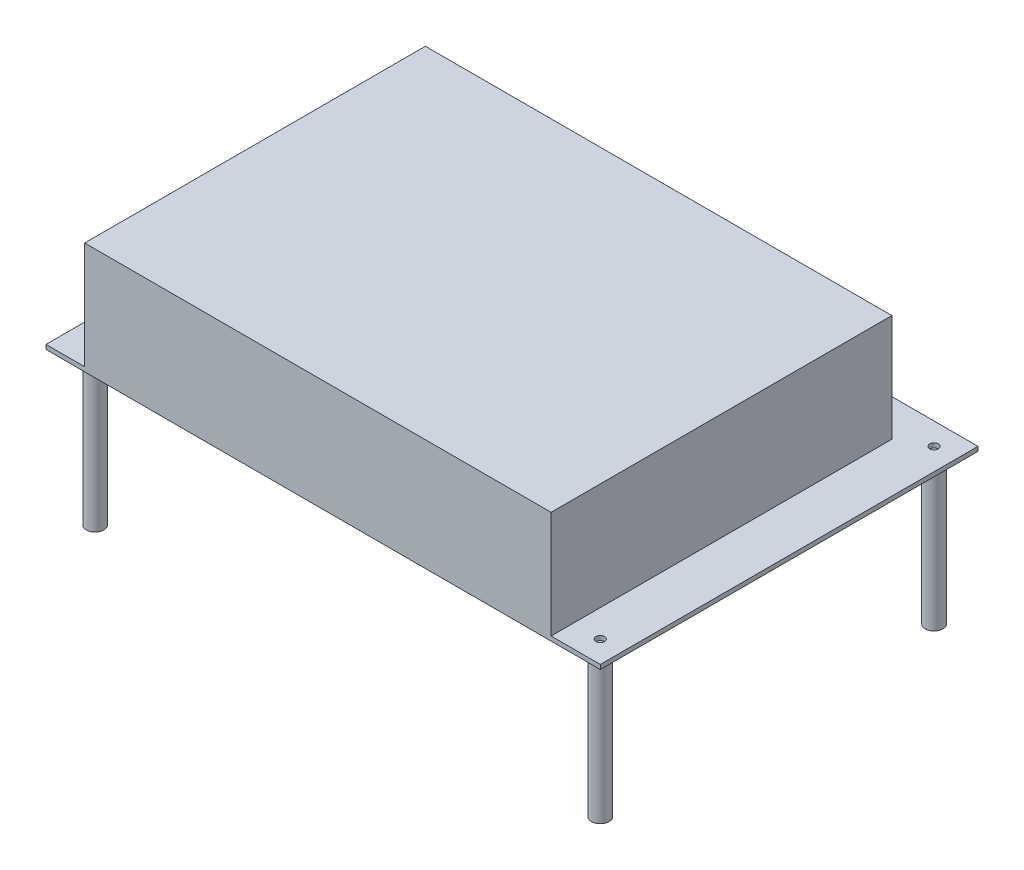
from build123d import *

# Parameters (mm, degrees)
SKETCH1_W           = 160.274
SKETCH1_H           = 109.22
BOSS_EXTRUDE1_DEPTH = 1.27
SKETCH2_W           = 134.874
SKETCH2_H           = 98.532874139
BOSS_EXTRUDE2_DEPTH = 30.988
SKETCH3_R           = 1.25
CUT_EXTRUDE1_DEPTH  = 30.988
SKETCH4_R           = 1.25
CUT_EXTRUDE2_DEPTH  = 30.988
SKETCH5_R           = 2.54
BOSS_EXTRUDE3_DEPTH = 43.18


with BuildPart() as part:
    # Sketch1 → Boss-Extrude1 (new body)
    with BuildSketch(Plane(origin=(0, 0, 0), x_dir=(1, 0, 0), z_dir=(0, 1, 0))):
        with Locations((80.137, 54.61)):
            Rectangle(SKETCH1_W, SKETCH1_H)
    extrude(amount=BOSS_EXTRUDE1_DEPTH)

    # Sketch2 → Boss-Extrude2 (add)
    with BuildSketch(Plane(origin=(0, 1.27, 0), x_dir=(1, 0, 0), z_dir=(0, 1, 0))):
        with Locations((78.613, 49.26643707)):
            Rectangle(SKETCH2_W, SKETCH2_H)
    extrude(amount=BOSS_EXTRUDE2_DEPTH)

    # Sketch3 → Cut-Extrude1 (cut)
    with BuildSketch(Plane.XZ):
        with Locations(Location((153.924, -6.35, 0), (0, 0, 270))):
            Circle(SKETCH3_R)
        with Locations(Location((153.924, -102.87, 0), (0, 0, 270))):
            Circle(SKETCH3_R)
    extrude(amount=-CUT_EXTRUDE1_DEPTH, mode=Mode.SUBTRACT)

    # Sketch4 → Cut-Extrude2 (cut)
    with BuildSketch(Plane.XZ):
        with Locations(Location((7.874, -6.35, 0), (0, 0, 270))):
            Circle(SKETCH4_R)
        with Locations(Location((7.874, -102.87, 0), (0, 0, 270))):
            Circle(SKETCH4_R)
    extrude(amount=-CUT_EXTRUDE2_DEPTH, mode=Mode.SUBTRACT)

    # Sketch5 → Boss-Extrude3 (add)
    with BuildSketch(Plane.XZ):
        with Locations(Location((7.874, -6.35, 0), (0, 0, 270))):
            Circle(SKETCH5_R)
        with Locations(Location((153.924, -6.35, 0), (0, 0, 270))):
            Circle(SKETCH5_R)
        with Locations(Location((7.874, -102.87, 0), (0, 0, 270))):
            Circle(SKETCH5_R)
        with Locations(Location((153.924, -102.87, 0), (0, 0, 270))):
            Circle(SKETCH5_R)
    extrude(amount=BOSS_EXTRUDE3_DEPTH)


solid = part.part
